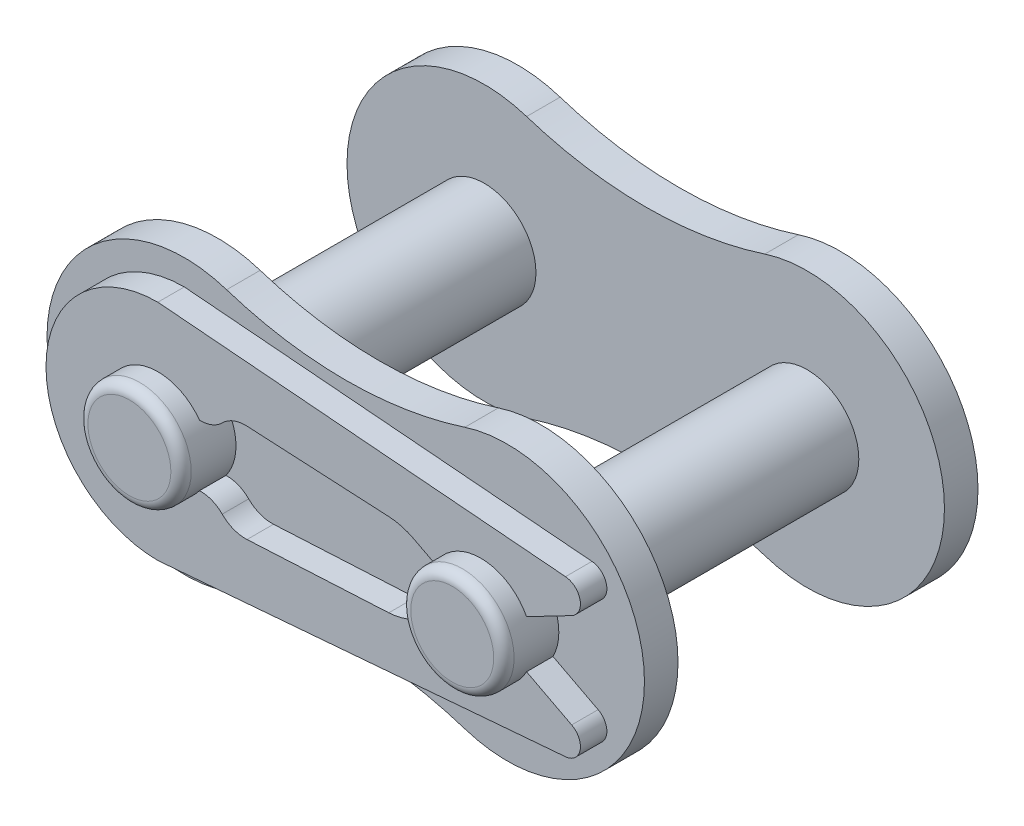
ISO-10303-21;
HEADER;
FILE_DESCRIPTION(('STEP AP214'),'2;1');
FILE_NAME('part.step','',(''),(''),'','','');
FILE_SCHEMA(('AUTOMOTIVE_DESIGN { 1 0 10303 214 1 1 1 1 }'));
ENDSEC;
DATA;
#1=APPLICATION_CONTEXT('core data for automotive mechanical design processes');
#2=APPLICATION_PROTOCOL_DEFINITION('international standard','automotive_design',2000,#1);
#3=PRODUCT_CONTEXT('',#1,'mechanical');
#4=PRODUCT('Part','Part','',(#3));
#5=PRODUCT_RELATED_PRODUCT_CATEGORY('part','',(#4));
#6=PRODUCT_DEFINITION_FORMATION('','',#4);
#7=PRODUCT_DEFINITION_CONTEXT('part definition',#1,'design');
#8=PRODUCT_DEFINITION('design','',#6,#7);
#9=PRODUCT_DEFINITION_SHAPE('','',#8);
#10=(LENGTH_UNIT() NAMED_UNIT(*) SI_UNIT(.MILLI.,.METRE.));
#11=(NAMED_UNIT(*) PLANE_ANGLE_UNIT() SI_UNIT($,.RADIAN.));
#12=(NAMED_UNIT(*) SI_UNIT($,.STERADIAN.) SOLID_ANGLE_UNIT());
#13=UNCERTAINTY_MEASURE_WITH_UNIT(LENGTH_MEASURE(1.E-05),#10,'distance_accuracy_value','');
#14=(GEOMETRIC_REPRESENTATION_CONTEXT(3) GLOBAL_UNCERTAINTY_ASSIGNED_CONTEXT((#13)) GLOBAL_UNIT_ASSIGNED_CONTEXT((#10,
#11,#12)) REPRESENTATION_CONTEXT('',''));
#15=CARTESIAN_POINT('',(0.,0.,0.));
#16=DIRECTION('',(0.,0.,1.));
#17=DIRECTION('',(1.,0.,0.));
#18=AXIS2_PLACEMENT_3D('',#15,#16,#17);
#19=CARTESIAN_POINT('',(-3.96875,12.2480467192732,8.2));
#20=DIRECTION('',(0.,0.,-1.));
#21=DIRECTION('',(1.,0.,0.));
#22=AXIS2_PLACEMENT_3D('',#19,#20,#21);
#23=PLANE('',#22);
#24=CARTESIAN_POINT('',(-13.775,3.,8.2));
#25=DIRECTION('',(0.,0.,1.));
#26=DIRECTION('',(1.,0.,0.));
#27=AXIS2_PLACEMENT_3D('',#24,#25,#26);
#28=CIRCLE('',#27,1.5);
#29=CARTESIAN_POINT('',(-13.8258507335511,1.50086218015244,8.2));
#30=VERTEX_POINT('',#29);
#31=CARTESIAN_POINT('',(-12.7104838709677,1.94320985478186,8.2));
#32=VERTEX_POINT('',#31);
#33=EDGE_CURVE('E298',#30,#32,#28,.T.);
#34=ORIENTED_EDGE('',*,*,#33,.F.);
#35=CARTESIAN_POINT('',(-15.875,0.,8.2));
#36=DIRECTION('',(0.,0.,-1.));
#37=DIRECTION('',(-1.,0.,0.));
#38=AXIS2_PLACEMENT_3D('',#35,#36,#37);
#39=CIRCLE('',#38,2.54);
#40=CARTESIAN_POINT('',(-13.8258507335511,-1.50086218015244,8.2));
#41=VERTEX_POINT('',#40);
#42=EDGE_CURVE('E39',#41,#30,#39,.F.);
#43=ORIENTED_EDGE('',*,*,#42,.F.);
#44=CARTESIAN_POINT('',(-13.775,-3.,8.2));
#45=DIRECTION('',(0.,0.,1.));
#46=DIRECTION('',(1.,0.,0.));
#47=AXIS2_PLACEMENT_3D('',#44,#45,#46);
#48=CIRCLE('',#47,1.5);
#49=CARTESIAN_POINT('',(-12.7104838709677,-1.94320985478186,8.2));
#50=VERTEX_POINT('',#49);
#51=EDGE_CURVE('E237',#41,#50,#48,.F.);
#52=ORIENTED_EDGE('',*,*,#51,.T.);
#53=CARTESIAN_POINT('',(-11.575,-0.815967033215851,8.2));
#54=DIRECTION('',(0.,0.,1.));
#55=DIRECTION('',(1.,0.,0.));
#56=AXIS2_PLACEMENT_3D('',#53,#54,#55);
#57=CIRCLE('',#56,1.6);
#58=CARTESIAN_POINT('',(-11.4912624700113,-2.41377428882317,8.2));
#59=VERTEX_POINT('',#58);
#60=EDGE_CURVE('E251',#59,#50,#57,.F.);
#61=ORIENTED_EDGE('',*,*,#60,.F.);
#62=DIRECTION('',(-0.998629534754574,-0.0523359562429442,0.));
#63=VECTOR('',#62,1.);
#64=CARTESIAN_POINT('',(0.094678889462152,-1.80658083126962,8.2));
#65=LINE('',#64,#63);
#66=CARTESIAN_POINT('',(-4.51997212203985,-2.04842444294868,8.2));
#67=VERTEX_POINT('',#66);
#68=EDGE_CURVE('E335',#67,#59,#65,.T.);
#69=ORIENTED_EDGE('',*,*,#68,.F.);
#70=CARTESIAN_POINT('',(-4.67697999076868,0.947464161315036,8.2));
#71=DIRECTION('',(0.,0.,1.));
#72=DIRECTION('',(1.,0.,0.));
#73=AXIS2_PLACEMENT_3D('',#70,#71,#72);
#74=CIRCLE('',#73,3.);
#75=CARTESIAN_POINT('',(-3.29173415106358,-1.71356833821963,8.2));
#76=VERTEX_POINT('',#75);
#77=EDGE_CURVE('E333',#76,#67,#74,.F.);
#78=ORIENTED_EDGE('',*,*,#77,.F.);
#79=DIRECTION('',(0.887010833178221,0.461748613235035,0.));
#80=VECTOR('',#79,1.);
#81=CARTESIAN_POINT('',(0.,0.,8.2));
#82=LINE('',#81,#80);
#83=CARTESIAN_POINT('',(-2.25300751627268,-1.17284147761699,8.2));
#84=VERTEX_POINT('',#83);
#85=EDGE_CURVE('E330',#76,#84,#82,.T.);
#86=ORIENTED_EDGE('',*,*,#85,.T.);
#87=CARTESIAN_POINT('',(0.,0.,8.2));
#88=DIRECTION('',(0.,0.,-1.));
#89=DIRECTION('',(-1.,0.,0.));
#90=AXIS2_PLACEMENT_3D('',#87,#88,#89);
#91=CIRCLE('',#90,2.54);
#92=CARTESIAN_POINT('',(-2.25300751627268,1.17284147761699,8.2));
#93=VERTEX_POINT('',#92);
#94=EDGE_CURVE('E44',#84,#93,#91,.T.);
#95=ORIENTED_EDGE('',*,*,#94,.T.);
#96=DIRECTION('',(0.887010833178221,-0.461748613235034,0.));
#97=VECTOR('',#96,1.);
#98=CARTESIAN_POINT('',(0.,0.,8.2));
#99=LINE('',#98,#97);
#100=CARTESIAN_POINT('',(-3.29173415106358,1.71356833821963,8.2));
#101=VERTEX_POINT('',#100);
#102=EDGE_CURVE('E310',#101,#93,#99,.T.);
#103=ORIENTED_EDGE('',*,*,#102,.F.);
#104=CARTESIAN_POINT('',(-4.67697999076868,-0.947464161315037,8.2));
#105=DIRECTION('',(0.,0.,1.));
#106=DIRECTION('',(1.,0.,0.));
#107=AXIS2_PLACEMENT_3D('',#104,#105,#106);
#108=CIRCLE('',#107,3.);
#109=CARTESIAN_POINT('',(-4.51997212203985,2.04842444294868,8.2));
#110=VERTEX_POINT('',#109);
#111=EDGE_CURVE('E307',#101,#110,#108,.T.);
#112=ORIENTED_EDGE('',*,*,#111,.T.);
#113=DIRECTION('',(-0.998629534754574,0.0523359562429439,0.));
#114=VECTOR('',#113,1.);
#115=CARTESIAN_POINT('',(0.0946788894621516,1.80658083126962,8.2));
#116=LINE('',#115,#114);
#117=CARTESIAN_POINT('',(-11.4912624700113,2.41377428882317,8.2));
#118=VERTEX_POINT('',#117);
#119=EDGE_CURVE('E304',#110,#118,#116,.T.);
#120=ORIENTED_EDGE('',*,*,#119,.T.);
#121=CARTESIAN_POINT('',(-11.575,0.815967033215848,8.2));
#122=DIRECTION('',(0.,0.,1.));
#123=DIRECTION('',(1.,0.,0.));
#124=AXIS2_PLACEMENT_3D('',#121,#122,#123);
#125=CIRCLE('',#124,1.6);
#126=EDGE_CURVE('E301',#118,#32,#125,.T.);
#127=ORIENTED_EDGE('',*,*,#126,.T.);
#128=EDGE_LOOP('',(#34,#43,#52,#61,#69,#78,#86,#95,#103,#112,#120,#127));
#129=FACE_BOUND('',#128,.T.);
#130=ADVANCED_FACE('F35',(#129),#23,.F.);
#131=CARTESIAN_POINT('',(-7.9375,24.4960934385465,8.2));
#132=DIRECTION('',(0.,0.,-1.));
#133=DIRECTION('',(1.,0.,0.));
#134=AXIS2_PLACEMENT_3D('',#131,#132,#133);
#135=CIRCLE('',#134,19.);
#136=CARTESIAN_POINT('',(-2.08070388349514,6.42130604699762,8.2));
#137=VERTEX_POINT('',#136);
#138=CARTESIAN_POINT('',(-13.7942961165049,6.42130604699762,8.2));
#139=VERTEX_POINT('',#138);
#140=EDGE_CURVE('E407',#137,#139,#135,.T.);
#141=ORIENTED_EDGE('',*,*,#140,.T.);
#142=CARTESIAN_POINT('',(-15.875,0.,8.2));
#143=DIRECTION('',(0.,0.,1.));
#144=DIRECTION('',(1.,0.,0.));
#145=AXIS2_PLACEMENT_3D('',#142,#143,#144);
#146=CIRCLE('',#145,6.75);
#147=CARTESIAN_POINT('',(-13.7942961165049,-6.42130604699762,8.2));
#148=VERTEX_POINT('',#147);
#149=EDGE_CURVE('E399',#139,#148,#146,.T.);
#150=ORIENTED_EDGE('',*,*,#149,.T.);
#151=CARTESIAN_POINT('',(-7.9375,-24.4960934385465,8.2));
#152=DIRECTION('',(0.,0.,-1.));
#153=DIRECTION('',(-1.,0.,0.));
#154=AXIS2_PLACEMENT_3D('',#151,#152,#153);
#155=CIRCLE('',#154,19.);
#156=CARTESIAN_POINT('',(-2.08070388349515,-6.42130604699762,8.2));
#157=VERTEX_POINT('',#156);
#158=EDGE_CURVE('E391',#148,#157,#155,.T.);
#159=ORIENTED_EDGE('',*,*,#158,.T.);
#160=CARTESIAN_POINT('',(0.,0.,8.2));
#161=DIRECTION('',(0.,0.,1.));
#162=DIRECTION('',(1.,0.,0.));
#163=AXIS2_PLACEMENT_3D('',#160,#161,#162);
#164=CIRCLE('',#163,6.75);
#165=EDGE_CURVE('E242',#157,#137,#164,.T.);
#166=ORIENTED_EDGE('',*,*,#165,.T.);
#167=EDGE_LOOP('',(#141,#150,#159,#166));
#168=FACE_BOUND('',#167,.T.);
#169=DIRECTION('',(0.887010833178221,0.461748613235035,0.));
#170=VECTOR('',#169,1.);
#171=CARTESIAN_POINT('',(0.,0.,8.2));
#172=LINE('',#171,#170);
#173=CARTESIAN_POINT('',(2.25300751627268,1.17284147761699,8.2));
#174=VERTEX_POINT('',#173);
#175=CARTESIAN_POINT('',(4.47141651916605,2.32767210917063,8.2));
#176=VERTEX_POINT('',#175);
#177=EDGE_CURVE('E312',#174,#176,#172,.T.);
#178=ORIENTED_EDGE('',*,*,#177,.F.);
#179=CARTESIAN_POINT('',(2.25300751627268,-1.17284147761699,8.2));
#180=VERTEX_POINT('',#179);
#181=EDGE_CURVE('E11',#174,#180,#91,.T.);
#182=ORIENTED_EDGE('',*,*,#181,.T.);
#183=DIRECTION('',(0.887010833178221,-0.461748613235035,0.));
#184=VECTOR('',#183,1.);
#185=CARTESIAN_POINT('',(0.,0.,8.2));
#186=LINE('',#185,#184);
#187=CARTESIAN_POINT('',(4.47141651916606,-2.32767210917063,8.2));
#188=VERTEX_POINT('',#187);
#189=EDGE_CURVE('E327',#180,#188,#186,.T.);
#190=ORIENTED_EDGE('',*,*,#189,.T.);
#191=CARTESIAN_POINT('',(4.10201762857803,-3.03728077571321,8.2));
#192=DIRECTION('',(0.,0.,1.));
#193=DIRECTION('',(1.,0.,0.));
#194=AXIS2_PLACEMENT_3D('',#191,#192,#193);
#195=CIRCLE('',#194,0.799999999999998);
#196=CARTESIAN_POINT('',(4.16826419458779,-3.83453317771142,8.2));
#197=VERTEX_POINT('',#196);
#198=EDGE_CURVE('E324',#197,#188,#195,.T.);
#199=ORIENTED_EDGE('',*,*,#198,.F.);
#200=DIRECTION('',(0.996565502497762,0.0828082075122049,0.));
#201=VECTOR('',#200,1.);
#202=CARTESIAN_POINT('',(0.345022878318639,-4.15222003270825,8.2));
#203=LINE('',#202,#201);
#204=CARTESIAN_POINT('',(-15.875,-5.5,8.2));
#205=VERTEX_POINT('',#204);
#206=EDGE_CURVE('E322',#205,#197,#203,.T.);
#207=ORIENTED_EDGE('',*,*,#206,.F.);
#208=CARTESIAN_POINT('',(-15.875,0.,8.2));
#209=DIRECTION('',(0.,0.,1.));
#210=DIRECTION('',(1.,0.,0.));
#211=AXIS2_PLACEMENT_3D('',#208,#209,#210);
#212=CIRCLE('',#211,5.5);
#213=CARTESIAN_POINT('',(-15.875,5.5,8.2));
#214=VERTEX_POINT('',#213);
#215=EDGE_CURVE('E320',#214,#205,#212,.T.);
#216=ORIENTED_EDGE('',*,*,#215,.F.);
#217=DIRECTION('',(0.996565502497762,-0.0828082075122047,0.));
#218=VECTOR('',#217,1.);
#219=CARTESIAN_POINT('',(0.345022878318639,4.15222003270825,8.2));
#220=LINE('',#219,#218);
#221=CARTESIAN_POINT('',(4.16826419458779,3.83453317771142,8.2));
#222=VERTEX_POINT('',#221);
#223=EDGE_CURVE('E317',#214,#222,#220,.T.);
#224=ORIENTED_EDGE('',*,*,#223,.T.);
#225=CARTESIAN_POINT('',(4.10201762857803,3.03728077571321,8.2));
#226=DIRECTION('',(0.,0.,1.));
#227=DIRECTION('',(1.,0.,0.));
#228=AXIS2_PLACEMENT_3D('',#225,#226,#227);
#229=CIRCLE('',#228,0.799999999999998);
#230=EDGE_CURVE('E314',#176,#222,#229,.T.);
#231=ORIENTED_EDGE('',*,*,#230,.F.);
#232=EDGE_LOOP('',(#178,#182,#190,#199,#207,#216,#224,#231));
#233=FACE_BOUND('',#232,.T.);
#234=ADVANCED_FACE('F497',(#168,#233),#23,.F.);
#235=CARTESIAN_POINT('',(0.,0.,-10.625));
#236=DIRECTION('',(0.,0.,-1.));
#237=DIRECTION('',(-1.,0.,0.));
#238=AXIS2_PLACEMENT_3D('',#235,#236,#237);
#239=CYLINDRICAL_SURFACE('',#238,2.54);
#240=CARTESIAN_POINT('',(0.,0.,10.4));
#241=DIRECTION('',(0.,0.,-1.));
#242=DIRECTION('',(-1.,0.,0.));
#243=AXIS2_PLACEMENT_3D('',#240,#241,#242);
#244=CIRCLE('',#243,2.54);
#245=CARTESIAN_POINT('',(-2.54,0.,10.4));
#246=VERTEX_POINT('',#245);
#247=EDGE_CURVE('E462',#246,#246,#244,.T.);
#248=ORIENTED_EDGE('',*,*,#247,.T.);
#249=EDGE_LOOP('',(#248));
#250=FACE_BOUND('',#249,.T.);
#251=DIRECTION('',(0.,0.,-1.));
#252=VECTOR('',#251,1.);
#253=CARTESIAN_POINT('',(-2.25300751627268,1.17284147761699,9.5));
#254=LINE('',#253,#252);
#255=CARTESIAN_POINT('',(-2.25300751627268,1.17284147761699,9.5));
#256=VERTEX_POINT('',#255);
#257=EDGE_CURVE('E370',#256,#93,#254,.T.);
#258=ORIENTED_EDGE('',*,*,#257,.T.);
#259=ORIENTED_EDGE('',*,*,#94,.F.);
#260=DIRECTION('',(0.,0.,-1.));
#261=VECTOR('',#260,1.);
#262=CARTESIAN_POINT('',(-2.25300751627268,-1.17284147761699,9.5));
#263=LINE('',#262,#261);
#264=CARTESIAN_POINT('',(-2.25300751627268,-1.17284147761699,9.5));
#265=VERTEX_POINT('',#264);
#266=EDGE_CURVE('E348',#265,#84,#263,.T.);
#267=ORIENTED_EDGE('',*,*,#266,.F.);
#268=CARTESIAN_POINT('',(0.,0.,9.5));
#269=DIRECTION('',(0.,0.,1.));
#270=DIRECTION('',(1.,0.,0.));
#271=AXIS2_PLACEMENT_3D('',#268,#269,#270);
#272=CIRCLE('',#271,2.54);
#273=CARTESIAN_POINT('',(2.25300751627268,-1.17284147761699,9.5));
#274=VERTEX_POINT('',#273);
#275=EDGE_CURVE('E274',#274,#265,#272,.F.);
#276=ORIENTED_EDGE('',*,*,#275,.F.);
#277=DIRECTION('',(0.,0.,-1.));
#278=VECTOR('',#277,1.);
#279=CARTESIAN_POINT('',(2.25300751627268,-1.17284147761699,9.5));
#280=LINE('',#279,#278);
#281=EDGE_CURVE('E350',#274,#180,#280,.T.);
#282=ORIENTED_EDGE('',*,*,#281,.T.);
#283=ORIENTED_EDGE('',*,*,#181,.F.);
#284=DIRECTION('',(0.,0.,-1.));
#285=VECTOR('',#284,1.);
#286=CARTESIAN_POINT('',(2.25300751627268,1.17284147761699,9.5));
#287=LINE('',#286,#285);
#288=CARTESIAN_POINT('',(2.25300751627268,1.17284147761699,9.5));
#289=VERTEX_POINT('',#288);
#290=EDGE_CURVE('E368',#289,#174,#287,.T.);
#291=ORIENTED_EDGE('',*,*,#290,.F.);
#292=EDGE_CURVE('E271',#256,#289,#272,.F.);
#293=ORIENTED_EDGE('',*,*,#292,.F.);
#294=EDGE_LOOP('',(#258,#259,#267,#276,#282,#283,#291,#293));
#295=FACE_BOUND('',#294,.T.);
#296=ADVANCED_FACE('F503',(#250,#295),#239,.T.);
#297=CARTESIAN_POINT('',(0.,0.,6.55));
#298=DIRECTION('',(0.,0.,-1.));
#299=DIRECTION('',(-1.,0.,0.));
#300=AXIS2_PLACEMENT_3D('',#297,#298,#299);
#301=CIRCLE('',#300,2.54);
#302=CARTESIAN_POINT('',(-2.54,0.,6.55));
#303=VERTEX_POINT('',#302);
#304=EDGE_CURVE('E413',#303,#303,#301,.T.);
#305=ORIENTED_EDGE('',*,*,#304,.T.);
#306=EDGE_LOOP('',(#305));
#307=FACE_BOUND('',#306,.T.);
#308=CARTESIAN_POINT('',(0.,0.,-6.55));
#309=DIRECTION('',(0.,0.,1.));
#310=DIRECTION('',(1.,0.,0.));
#311=AXIS2_PLACEMENT_3D('',#308,#309,#310);
#312=CIRCLE('',#311,2.54);
#313=CARTESIAN_POINT('',(2.54,0.,-6.55));
#314=VERTEX_POINT('',#313);
#315=EDGE_CURVE('E430',#314,#314,#312,.T.);
#316=ORIENTED_EDGE('',*,*,#315,.T.);
#317=EDGE_LOOP('',(#316));
#318=FACE_BOUND('',#317,.T.);
#319=ADVANCED_FACE('F491',(#307,#318),#239,.T.);
#320=CARTESIAN_POINT('',(-3.96875,12.2480467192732,-8.2));
#321=DIRECTION('',(0.,0.,1.));
#322=DIRECTION('',(1.,0.,0.));
#323=AXIS2_PLACEMENT_3D('',#320,#321,#322);
#324=PLANE('',#323);
#325=CARTESIAN_POINT('',(-15.875,0.,-8.2));
#326=DIRECTION('',(0.,0.,1.));
#327=DIRECTION('',(1.,0.,0.));
#328=AXIS2_PLACEMENT_3D('',#325,#326,#327);
#329=CIRCLE('',#328,4.1);
#330=CARTESIAN_POINT('',(-11.775,0.,-8.2));
#331=VERTEX_POINT('',#330);
#332=EDGE_CURVE('E421',#331,#331,#329,.T.);
#333=ORIENTED_EDGE('',*,*,#332,.T.);
#334=EDGE_LOOP('',(#333));
#335=FACE_BOUND('',#334,.T.);
#336=CARTESIAN_POINT('',(-7.9375,24.4960934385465,-8.2));
#337=DIRECTION('',(0.,0.,-1.));
#338=DIRECTION('',(1.,0.,0.));
#339=AXIS2_PLACEMENT_3D('',#336,#337,#338);
#340=CIRCLE('',#339,19.);
#341=CARTESIAN_POINT('',(-2.08070388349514,6.42130604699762,-8.2));
#342=VERTEX_POINT('',#341);
#343=CARTESIAN_POINT('',(-13.7942961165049,6.42130604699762,-8.2));
#344=VERTEX_POINT('',#343);
#345=EDGE_CURVE('E433',#342,#344,#340,.T.);
#346=ORIENTED_EDGE('',*,*,#345,.F.);
#347=CARTESIAN_POINT('',(0.,0.,-8.2));
#348=DIRECTION('',(0.,0.,1.));
#349=DIRECTION('',(1.,0.,0.));
#350=AXIS2_PLACEMENT_3D('',#347,#348,#349);
#351=CIRCLE('',#350,6.75);
#352=CARTESIAN_POINT('',(-2.08070388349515,-6.42130604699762,-8.2));
#353=VERTEX_POINT('',#352);
#354=EDGE_CURVE('E82',#353,#342,#351,.T.);
#355=ORIENTED_EDGE('',*,*,#354,.F.);
#356=CARTESIAN_POINT('',(-7.9375,-24.4960934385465,-8.2));
#357=DIRECTION('',(0.,0.,-1.));
#358=DIRECTION('',(-1.,0.,0.));
#359=AXIS2_PLACEMENT_3D('',#356,#357,#358);
#360=CIRCLE('',#359,19.);
#361=CARTESIAN_POINT('',(-13.7942961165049,-6.42130604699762,-8.2));
#362=VERTEX_POINT('',#361);
#363=EDGE_CURVE('E445',#362,#353,#360,.T.);
#364=ORIENTED_EDGE('',*,*,#363,.F.);
#365=CARTESIAN_POINT('',(-15.875,0.,-8.2));
#366=DIRECTION('',(0.,0.,1.));
#367=DIRECTION('',(1.,0.,0.));
#368=AXIS2_PLACEMENT_3D('',#365,#366,#367);
#369=CIRCLE('',#368,6.75);
#370=EDGE_CURVE('E443',#344,#362,#369,.T.);
#371=ORIENTED_EDGE('',*,*,#370,.F.);
#372=EDGE_LOOP('',(#346,#355,#364,#371));
#373=FACE_BOUND('',#372,.T.);
#374=CARTESIAN_POINT('',(0.,0.,-8.2));
#375=DIRECTION('',(0.,0.,1.));
#376=DIRECTION('',(1.,0.,0.));
#377=AXIS2_PLACEMENT_3D('',#374,#375,#376);
#378=CIRCLE('',#377,4.1);
#379=CARTESIAN_POINT('',(4.1,0.,-8.2));
#380=VERTEX_POINT('',#379);
#381=EDGE_CURVE('E456',#380,#380,#378,.T.);
#382=ORIENTED_EDGE('',*,*,#381,.T.);
#383=EDGE_LOOP('',(#382));
#384=FACE_BOUND('',#383,.T.);
#385=ADVANCED_FACE('F481',(#335,#373,#384),#324,.F.);
#386=CARTESIAN_POINT('',(-3.96875,12.2480467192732,-6.55));
#387=DIRECTION('',(0.,0.,1.));
#388=DIRECTION('',(1.,0.,0.));
#389=AXIS2_PLACEMENT_3D('',#386,#387,#388);
#390=PLANE('',#389);
#391=ORIENTED_EDGE('',*,*,#315,.F.);
#392=EDGE_LOOP('',(#391));
#393=FACE_BOUND('',#392,.T.);
#394=CARTESIAN_POINT('',(-7.9375,24.4960934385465,-6.55));
#395=DIRECTION('',(0.,0.,-1.));
#396=DIRECTION('',(1.,0.,0.));
#397=AXIS2_PLACEMENT_3D('',#394,#395,#396);
#398=CIRCLE('',#397,19.);
#399=CARTESIAN_POINT('',(-2.08070388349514,6.42130604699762,-6.55));
#400=VERTEX_POINT('',#399);
#401=CARTESIAN_POINT('',(-13.7942961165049,6.42130604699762,-6.55));
#402=VERTEX_POINT('',#401);
#403=EDGE_CURVE('E434',#400,#402,#398,.T.);
#404=ORIENTED_EDGE('',*,*,#403,.T.);
#405=CARTESIAN_POINT('',(-15.875,0.,-6.55));
#406=DIRECTION('',(0.,0.,1.));
#407=DIRECTION('',(1.,0.,0.));
#408=AXIS2_PLACEMENT_3D('',#405,#406,#407);
#409=CIRCLE('',#408,6.75);
#410=CARTESIAN_POINT('',(-13.7942961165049,-6.42130604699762,-6.55));
#411=VERTEX_POINT('',#410);
#412=EDGE_CURVE('E90',#402,#411,#409,.T.);
#413=ORIENTED_EDGE('',*,*,#412,.T.);
#414=CARTESIAN_POINT('',(-7.9375,-24.4960934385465,-6.55));
#415=DIRECTION('',(0.,0.,-1.));
#416=DIRECTION('',(-1.,0.,0.));
#417=AXIS2_PLACEMENT_3D('',#414,#415,#416);
#418=CIRCLE('',#417,19.);
#419=CARTESIAN_POINT('',(-2.08070388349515,-6.42130604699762,-6.55));
#420=VERTEX_POINT('',#419);
#421=EDGE_CURVE('E437',#411,#420,#418,.T.);
#422=ORIENTED_EDGE('',*,*,#421,.T.);
#423=CARTESIAN_POINT('',(0.,0.,-6.55));
#424=DIRECTION('',(0.,0.,1.));
#425=DIRECTION('',(1.,0.,0.));
#426=AXIS2_PLACEMENT_3D('',#423,#424,#425);
#427=CIRCLE('',#426,6.75);
#428=EDGE_CURVE('E61',#420,#400,#427,.T.);
#429=ORIENTED_EDGE('',*,*,#428,.T.);
#430=EDGE_LOOP('',(#404,#413,#422,#429));
#431=FACE_BOUND('',#430,.T.);
#432=CARTESIAN_POINT('',(-15.875,0.,-6.55));
#433=DIRECTION('',(0.,0.,1.));
#434=DIRECTION('',(1.,0.,0.));
#435=AXIS2_PLACEMENT_3D('',#432,#433,#434);
#436=CIRCLE('',#435,2.54);
#437=CARTESIAN_POINT('',(-13.335,0.,-6.55));
#438=VERTEX_POINT('',#437);
#439=EDGE_CURVE('E427',#438,#438,#436,.T.);
#440=ORIENTED_EDGE('',*,*,#439,.F.);
#441=EDGE_LOOP('',(#440));
#442=FACE_BOUND('',#441,.T.);
#443=ADVANCED_FACE('F478',(#393,#431,#442),#390,.T.);
#444=CARTESIAN_POINT('',(-7.9375,24.4960934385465,-6.55));
#445=DIRECTION('',(0.,0.,-1.));
#446=DIRECTION('',(-1.,0.,0.));
#447=AXIS2_PLACEMENT_3D('',#444,#445,#446);
#448=CYLINDRICAL_SURFACE('',#447,19.);
#449=ORIENTED_EDGE('',*,*,#345,.T.);
#450=DIRECTION('',(0.,0.,-1.));
#451=VECTOR('',#450,1.);
#452=CARTESIAN_POINT('',(-13.7942961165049,6.42130604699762,-6.55));
#453=LINE('',#452,#451);
#454=EDGE_CURVE('E454',#402,#344,#453,.T.);
#455=ORIENTED_EDGE('',*,*,#454,.F.);
#456=ORIENTED_EDGE('',*,*,#403,.F.);
#457=DIRECTION('',(0.,0.,-1.));
#458=VECTOR('',#457,1.);
#459=CARTESIAN_POINT('',(-2.08070388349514,6.42130604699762,-6.55));
#460=LINE('',#459,#458);
#461=EDGE_CURVE('E440',#400,#342,#460,.T.);
#462=ORIENTED_EDGE('',*,*,#461,.T.);
#463=EDGE_LOOP('',(#449,#455,#456,#462));
#464=FACE_BOUND('',#463,.T.);
#465=ADVANCED_FACE('F480',(#464),#448,.F.);
#466=CARTESIAN_POINT('',(-15.875,0.,-6.55));
#467=DIRECTION('',(0.,0.,-1.));
#468=DIRECTION('',(-1.,0.,0.));
#469=AXIS2_PLACEMENT_3D('',#466,#467,#468);
#470=CYLINDRICAL_SURFACE('',#469,6.75);
#471=ORIENTED_EDGE('',*,*,#370,.T.);
#472=DIRECTION('',(0.,0.,-1.));
#473=VECTOR('',#472,1.);
#474=CARTESIAN_POINT('',(-13.7942961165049,-6.42130604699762,-6.55));
#475=LINE('',#474,#473);
#476=EDGE_CURVE('E451',#411,#362,#475,.T.);
#477=ORIENTED_EDGE('',*,*,#476,.F.);
#478=ORIENTED_EDGE('',*,*,#412,.F.);
#479=ORIENTED_EDGE('',*,*,#454,.T.);
#480=EDGE_LOOP('',(#471,#477,#478,#479));
#481=FACE_BOUND('',#480,.T.);
#482=ADVANCED_FACE('F488',(#481),#470,.T.);
#483=CARTESIAN_POINT('',(-7.9375,-24.4960934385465,-6.55));
#484=DIRECTION('',(0.,0.,-1.));
#485=DIRECTION('',(-1.,0.,0.));
#486=AXIS2_PLACEMENT_3D('',#483,#484,#485);
#487=CYLINDRICAL_SURFACE('',#486,19.);
#488=ORIENTED_EDGE('',*,*,#363,.T.);
#489=DIRECTION('',(0.,0.,-1.));
#490=VECTOR('',#489,1.);
#491=CARTESIAN_POINT('',(-2.08070388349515,-6.42130604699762,-6.55));
#492=LINE('',#491,#490);
#493=EDGE_CURVE('E449',#420,#353,#492,.T.);
#494=ORIENTED_EDGE('',*,*,#493,.F.);
#495=ORIENTED_EDGE('',*,*,#421,.F.);
#496=ORIENTED_EDGE('',*,*,#476,.T.);
#497=EDGE_LOOP('',(#488,#494,#495,#496));
#498=FACE_BOUND('',#497,.T.);
#499=ADVANCED_FACE('F751',(#498),#487,.F.);
#500=CARTESIAN_POINT('',(0.,0.,-6.55));
#501=DIRECTION('',(0.,0.,-1.));
#502=DIRECTION('',(-1.,0.,0.));
#503=AXIS2_PLACEMENT_3D('',#500,#501,#502);
#504=CYLINDRICAL_SURFACE('',#503,6.75);
#505=ORIENTED_EDGE('',*,*,#354,.T.);
#506=ORIENTED_EDGE('',*,*,#461,.F.);
#507=ORIENTED_EDGE('',*,*,#428,.F.);
#508=ORIENTED_EDGE('',*,*,#493,.T.);
#509=EDGE_LOOP('',(#505,#506,#507,#508));
#510=FACE_BOUND('',#509,.T.);
#511=ADVANCED_FACE('F539',(#510),#504,.T.);
#512=CARTESIAN_POINT('',(0.,0.,-2.89642857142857));
#513=DIRECTION('',(0.,0.,-1.));
#514=DIRECTION('',(1.,0.,0.));
#515=AXIS2_PLACEMENT_3D('',#512,#513,#514);
#516=SPHERICAL_SURFACE('',#515,6.70357142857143);
#517=ORIENTED_EDGE('',*,*,#381,.F.);
#518=EDGE_LOOP('',(#517));
#519=FACE_BOUND('',#518,.T.);
#520=ADVANCED_FACE('F474',(#519),#516,.T.);
#521=CARTESIAN_POINT('',(-15.875,0.,10.9));
#522=DIRECTION('',(0.,0.,1.));
#523=DIRECTION('',(1.,0.,0.));
#524=AXIS2_PLACEMENT_3D('',#521,#522,#523);
#525=CYLINDRICAL_SURFACE('',#524,2.54);
#526=CARTESIAN_POINT('',(-15.875,0.,6.55));
#527=DIRECTION('',(0.,0.,-1.));
#528=DIRECTION('',(-1.,0.,0.));
#529=AXIS2_PLACEMENT_3D('',#526,#527,#528);
#530=CIRCLE('',#529,2.54);
#531=CARTESIAN_POINT('',(-18.415,0.,6.55));
#532=VERTEX_POINT('',#531);
#533=EDGE_CURVE('E417',#532,#532,#530,.F.);
#534=ORIENTED_EDGE('',*,*,#533,.F.);
#535=EDGE_LOOP('',(#534));
#536=FACE_BOUND('',#535,.T.);
#537=ORIENTED_EDGE('',*,*,#439,.T.);
#538=EDGE_LOOP('',(#537));
#539=FACE_BOUND('',#538,.T.);
#540=ADVANCED_FACE('F470',(#536,#539),#525,.T.);
#541=CARTESIAN_POINT('',(-15.875,0.,-2.89642857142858));
#542=DIRECTION('',(0.,0.,1.));
#543=DIRECTION('',(-1.,0.,0.));
#544=AXIS2_PLACEMENT_3D('',#541,#542,#543);
#545=SPHERICAL_SURFACE('',#544,6.70357142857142);
#546=ORIENTED_EDGE('',*,*,#332,.F.);
#547=EDGE_LOOP('',(#546));
#548=FACE_BOUND('',#547,.T.);
#549=ADVANCED_FACE('F473',(#548),#545,.T.);
#550=CARTESIAN_POINT('',(-3.96875,12.2480467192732,6.55));
#551=DIRECTION('',(0.,0.,-1.));
#552=DIRECTION('',(1.,0.,0.));
#553=AXIS2_PLACEMENT_3D('',#550,#551,#552);
#554=PLANE('',#553);
#555=ORIENTED_EDGE('',*,*,#533,.T.);
#556=EDGE_LOOP('',(#555));
#557=FACE_BOUND('',#556,.T.);
#558=CARTESIAN_POINT('',(-7.9375,24.4960934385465,6.55));
#559=DIRECTION('',(0.,0.,-1.));
#560=DIRECTION('',(1.,0.,0.));
#561=AXIS2_PLACEMENT_3D('',#558,#559,#560);
#562=CIRCLE('',#561,19.);
#563=CARTESIAN_POINT('',(-2.08070388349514,6.42130604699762,6.55));
#564=VERTEX_POINT('',#563);
#565=CARTESIAN_POINT('',(-13.7942961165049,6.42130604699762,6.55));
#566=VERTEX_POINT('',#565);
#567=EDGE_CURVE('E410',#564,#566,#562,.T.);
#568=ORIENTED_EDGE('',*,*,#567,.F.);
#569=CARTESIAN_POINT('',(0.,0.,6.55));
#570=DIRECTION('',(0.,0.,1.));
#571=DIRECTION('',(1.,0.,0.));
#572=AXIS2_PLACEMENT_3D('',#569,#570,#571);
#573=CIRCLE('',#572,6.75);
#574=CARTESIAN_POINT('',(-2.08070388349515,-6.42130604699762,6.55));
#575=VERTEX_POINT('',#574);
#576=EDGE_CURVE('E386',#575,#564,#573,.T.);
#577=ORIENTED_EDGE('',*,*,#576,.F.);
#578=CARTESIAN_POINT('',(-7.9375,-24.4960934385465,6.55));
#579=DIRECTION('',(0.,0.,-1.));
#580=DIRECTION('',(-1.,0.,0.));
#581=AXIS2_PLACEMENT_3D('',#578,#579,#580);
#582=CIRCLE('',#581,19.);
#583=CARTESIAN_POINT('',(-13.7942961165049,-6.42130604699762,6.55));
#584=VERTEX_POINT('',#583);
#585=EDGE_CURVE('E394',#584,#575,#582,.T.);
#586=ORIENTED_EDGE('',*,*,#585,.F.);
#587=CARTESIAN_POINT('',(-15.875,0.,6.55));
#588=DIRECTION('',(0.,0.,1.));
#589=DIRECTION('',(1.,0.,0.));
#590=AXIS2_PLACEMENT_3D('',#587,#588,#589);
#591=CIRCLE('',#590,6.75);
#592=EDGE_CURVE('E402',#566,#584,#591,.T.);
#593=ORIENTED_EDGE('',*,*,#592,.F.);
#594=EDGE_LOOP('',(#568,#577,#586,#593));
#595=FACE_BOUND('',#594,.T.);
#596=ORIENTED_EDGE('',*,*,#304,.F.);
#597=EDGE_LOOP('',(#596));
#598=FACE_BOUND('',#597,.T.);
#599=ADVANCED_FACE('F467',(#557,#595,#598),#554,.T.);
#600=CARTESIAN_POINT('',(-7.9375,24.4960934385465,6.55));
#601=DIRECTION('',(0.,0.,1.));
#602=DIRECTION('',(-1.,0.,0.));
#603=AXIS2_PLACEMENT_3D('',#600,#601,#602);
#604=CYLINDRICAL_SURFACE('',#603,19.);
#605=ORIENTED_EDGE('',*,*,#140,.F.);
#606=DIRECTION('',(0.,0.,1.));
#607=VECTOR('',#606,1.);
#608=CARTESIAN_POINT('',(-2.08070388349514,6.42130604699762,6.55));
#609=LINE('',#608,#607);
#610=EDGE_CURVE('E384',#564,#137,#609,.T.);
#611=ORIENTED_EDGE('',*,*,#610,.F.);
#612=ORIENTED_EDGE('',*,*,#567,.T.);
#613=DIRECTION('',(0.,0.,1.));
#614=VECTOR('',#613,1.);
#615=CARTESIAN_POINT('',(-13.7942961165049,6.42130604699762,6.55));
#616=LINE('',#615,#614);
#617=EDGE_CURVE('E405',#566,#139,#616,.T.);
#618=ORIENTED_EDGE('',*,*,#617,.T.);
#619=EDGE_LOOP('',(#605,#611,#612,#618));
#620=FACE_BOUND('',#619,.T.);
#621=ADVANCED_FACE('F551',(#620),#604,.F.);
#622=CARTESIAN_POINT('',(-15.875,0.,6.55));
#623=DIRECTION('',(0.,0.,1.));
#624=DIRECTION('',(-1.,0.,0.));
#625=AXIS2_PLACEMENT_3D('',#622,#623,#624);
#626=CYLINDRICAL_SURFACE('',#625,6.75);
#627=ORIENTED_EDGE('',*,*,#149,.F.);
#628=ORIENTED_EDGE('',*,*,#617,.F.);
#629=ORIENTED_EDGE('',*,*,#592,.T.);
#630=DIRECTION('',(0.,0.,1.));
#631=VECTOR('',#630,1.);
#632=CARTESIAN_POINT('',(-13.7942961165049,-6.42130604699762,6.55));
#633=LINE('',#632,#631);
#634=EDGE_CURVE('E397',#584,#148,#633,.T.);
#635=ORIENTED_EDGE('',*,*,#634,.T.);
#636=EDGE_LOOP('',(#627,#628,#629,#635));
#637=FACE_BOUND('',#636,.T.);
#638=ADVANCED_FACE('F555',(#637),#626,.T.);
#639=CARTESIAN_POINT('',(-7.9375,-24.4960934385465,6.55));
#640=DIRECTION('',(0.,0.,1.));
#641=DIRECTION('',(-1.,0.,0.));
#642=AXIS2_PLACEMENT_3D('',#639,#640,#641);
#643=CYLINDRICAL_SURFACE('',#642,19.);
#644=ORIENTED_EDGE('',*,*,#158,.F.);
#645=ORIENTED_EDGE('',*,*,#634,.F.);
#646=ORIENTED_EDGE('',*,*,#585,.T.);
#647=DIRECTION('',(0.,0.,1.));
#648=VECTOR('',#647,1.);
#649=CARTESIAN_POINT('',(-2.08070388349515,-6.42130604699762,6.55));
#650=LINE('',#649,#648);
#651=EDGE_CURVE('E389',#575,#157,#650,.T.);
#652=ORIENTED_EDGE('',*,*,#651,.T.);
#653=EDGE_LOOP('',(#644,#645,#646,#652));
#654=FACE_BOUND('',#653,.T.);
#655=ADVANCED_FACE('F560',(#654),#643,.F.);
#656=CARTESIAN_POINT('',(0.,0.,6.55));
#657=DIRECTION('',(0.,0.,1.));
#658=DIRECTION('',(-1.,0.,0.));
#659=AXIS2_PLACEMENT_3D('',#656,#657,#658);
#660=CYLINDRICAL_SURFACE('',#659,6.75);
#661=ORIENTED_EDGE('',*,*,#165,.F.);
#662=ORIENTED_EDGE('',*,*,#651,.F.);
#663=ORIENTED_EDGE('',*,*,#576,.T.);
#664=ORIENTED_EDGE('',*,*,#610,.T.);
#665=EDGE_LOOP('',(#661,#662,#663,#664));
#666=FACE_BOUND('',#665,.T.);
#667=ADVANCED_FACE('F515',(#666),#660,.T.);
#668=CARTESIAN_POINT('',(-15.875,0.,10.9));
#669=DIRECTION('',(0.,0.,1.));
#670=DIRECTION('',(1.,0.,0.));
#671=AXIS2_PLACEMENT_3D('',#668,#669,#670);
#672=PLANE('',#671);
#673=CARTESIAN_POINT('',(-15.875,0.,10.9));
#674=DIRECTION('',(0.,0.,1.));
#675=DIRECTION('',(1.,0.,0.));
#676=AXIS2_PLACEMENT_3D('',#673,#674,#675);
#677=CIRCLE('',#676,2.04);
#678=CARTESIAN_POINT('',(-13.835,0.,10.9));
#679=VERTEX_POINT('',#678);
#680=EDGE_CURVE('E424',#679,#679,#677,.T.);
#681=ORIENTED_EDGE('',*,*,#680,.T.);
#682=EDGE_LOOP('',(#681));
#683=FACE_BOUND('',#682,.T.);
#684=ADVANCED_FACE('F512',(#683),#672,.T.);
#685=CARTESIAN_POINT('',(-15.875,0.,10.4));
#686=DIRECTION('',(0.,0.,1.));
#687=DIRECTION('',(1.,0.,0.));
#688=AXIS2_PLACEMENT_3D('',#685,#686,#687);
#689=TOROIDAL_SURFACE('',#688,2.04,0.5);
#690=CARTESIAN_POINT('',(-15.875,0.,10.4));
#691=DIRECTION('',(0.,0.,1.));
#692=DIRECTION('',(1.,0.,0.));
#693=AXIS2_PLACEMENT_3D('',#690,#691,#692);
#694=CIRCLE('',#693,2.54);
#695=CARTESIAN_POINT('',(-13.335,0.,10.4));
#696=VERTEX_POINT('',#695);
#697=EDGE_CURVE('E418',#696,#696,#694,.T.);
#698=ORIENTED_EDGE('',*,*,#697,.T.);
#699=EDGE_LOOP('',(#698));
#700=FACE_BOUND('',#699,.T.);
#701=ORIENTED_EDGE('',*,*,#680,.F.);
#702=EDGE_LOOP('',(#701));
#703=FACE_BOUND('',#702,.T.);
#704=ADVANCED_FACE('F514',(#700,#703),#689,.T.);
#705=DIRECTION('',(0.,0.,-1.));
#706=VECTOR('',#705,1.);
#707=CARTESIAN_POINT('',(-13.8258507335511,-1.50086218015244,9.5));
#708=LINE('',#707,#706);
#709=CARTESIAN_POINT('',(-13.8258507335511,-1.50086218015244,9.5));
#710=VERTEX_POINT('',#709);
#711=EDGE_CURVE('E232',#710,#41,#708,.T.);
#712=ORIENTED_EDGE('',*,*,#711,.T.);
#713=ORIENTED_EDGE('',*,*,#42,.T.);
#714=DIRECTION('',(0.,0.,-1.));
#715=VECTOR('',#714,1.);
#716=CARTESIAN_POINT('',(-13.8258507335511,1.50086218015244,9.5));
#717=LINE('',#716,#715);
#718=CARTESIAN_POINT('',(-13.8258507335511,1.50086218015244,9.5));
#719=VERTEX_POINT('',#718);
#720=EDGE_CURVE('E243',#719,#30,#717,.T.);
#721=ORIENTED_EDGE('',*,*,#720,.F.);
#722=CARTESIAN_POINT('',(-15.875,0.,9.5));
#723=DIRECTION('',(0.,0.,1.));
#724=DIRECTION('',(1.,0.,0.));
#725=AXIS2_PLACEMENT_3D('',#722,#723,#724);
#726=CIRCLE('',#725,2.54);
#727=EDGE_CURVE('E246',#710,#719,#726,.F.);
#728=ORIENTED_EDGE('',*,*,#727,.F.);
#729=EDGE_LOOP('',(#712,#713,#721,#728));
#730=FACE_BOUND('',#729,.T.);
#731=ORIENTED_EDGE('',*,*,#697,.F.);
#732=EDGE_LOOP('',(#731));
#733=FACE_BOUND('',#732,.T.);
#734=ADVANCED_FACE('F254',(#730,#733),#525,.T.);
#735=CARTESIAN_POINT('',(2.04,0.,10.9));
#736=DIRECTION('',(0.,0.,-1.));
#737=DIRECTION('',(-1.,0.,0.));
#738=AXIS2_PLACEMENT_3D('',#735,#736,#737);
#739=PLANE('',#738);
#740=CARTESIAN_POINT('',(0.,0.,10.9));
#741=DIRECTION('',(0.,0.,-1.));
#742=DIRECTION('',(-1.,0.,0.));
#743=AXIS2_PLACEMENT_3D('',#740,#741,#742);
#744=CIRCLE('',#743,2.04);
#745=CARTESIAN_POINT('',(-2.04,0.,10.9));
#746=VERTEX_POINT('',#745);
#747=EDGE_CURVE('E459',#746,#746,#744,.T.);
#748=ORIENTED_EDGE('',*,*,#747,.F.);
#749=EDGE_LOOP('',(#748));
#750=FACE_BOUND('',#749,.T.);
#751=ADVANCED_FACE('F522',(#750),#739,.F.);
#752=CARTESIAN_POINT('',(0.,0.,10.4));
#753=DIRECTION('',(0.,0.,-1.));
#754=DIRECTION('',(-1.,0.,0.));
#755=AXIS2_PLACEMENT_3D('',#752,#753,#754);
#756=TOROIDAL_SURFACE('',#755,2.04,0.5);
#757=ORIENTED_EDGE('',*,*,#247,.F.);
#758=EDGE_LOOP('',(#757));
#759=FACE_BOUND('',#758,.T.);
#760=ORIENTED_EDGE('',*,*,#747,.T.);
#761=EDGE_LOOP('',(#760));
#762=FACE_BOUND('',#761,.T.);
#763=ADVANCED_FACE('F37',(#759,#762),#756,.T.);
#764=CARTESIAN_POINT('',(-13.775,-3.,9.5));
#765=DIRECTION('',(0.,0.,-1.));
#766=DIRECTION('',(-1.,0.,0.));
#767=AXIS2_PLACEMENT_3D('',#764,#765,#766);
#768=CYLINDRICAL_SURFACE('',#767,1.5);
#769=ORIENTED_EDGE('',*,*,#51,.F.);
#770=ORIENTED_EDGE('',*,*,#711,.F.);
#771=CARTESIAN_POINT('',(-13.775,-3.,9.5));
#772=DIRECTION('',(0.,0.,1.));
#773=DIRECTION('',(1.,0.,0.));
#774=AXIS2_PLACEMENT_3D('',#771,#772,#773);
#775=CIRCLE('',#774,1.5);
#776=CARTESIAN_POINT('',(-12.7104838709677,-1.94320985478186,9.5));
#777=VERTEX_POINT('',#776);
#778=EDGE_CURVE('E235',#710,#777,#775,.F.);
#779=ORIENTED_EDGE('',*,*,#778,.T.);
#780=DIRECTION('',(0.,0.,-1.));
#781=VECTOR('',#780,1.);
#782=CARTESIAN_POINT('',(-12.7104838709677,-1.94320985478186,9.5));
#783=LINE('',#782,#781);
#784=EDGE_CURVE('E296',#777,#50,#783,.T.);
#785=ORIENTED_EDGE('',*,*,#784,.T.);
#786=EDGE_LOOP('',(#769,#770,#779,#785));
#787=FACE_BOUND('',#786,.T.);
#788=ADVANCED_FACE('F234',(#787),#768,.T.);
#789=CARTESIAN_POINT('',(-13.775,3.,9.5));
#790=DIRECTION('',(0.,0.,-1.));
#791=DIRECTION('',(-1.,0.,0.));
#792=AXIS2_PLACEMENT_3D('',#789,#790,#791);
#793=CYLINDRICAL_SURFACE('',#792,1.5);
#794=ORIENTED_EDGE('',*,*,#33,.T.);
#795=DIRECTION('',(0.,0.,-1.));
#796=VECTOR('',#795,1.);
#797=CARTESIAN_POINT('',(-12.7104838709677,1.94320985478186,9.5));
#798=LINE('',#797,#796);
#799=CARTESIAN_POINT('',(-12.7104838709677,1.94320985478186,9.5));
#800=VERTEX_POINT('',#799);
#801=EDGE_CURVE('E379',#800,#32,#798,.T.);
#802=ORIENTED_EDGE('',*,*,#801,.F.);
#803=CARTESIAN_POINT('',(-13.775,3.,9.5));
#804=DIRECTION('',(0.,0.,1.));
#805=DIRECTION('',(1.,0.,0.));
#806=AXIS2_PLACEMENT_3D('',#803,#804,#805);
#807=CIRCLE('',#806,1.5);
#808=EDGE_CURVE('E256',#719,#800,#807,.T.);
#809=ORIENTED_EDGE('',*,*,#808,.F.);
#810=ORIENTED_EDGE('',*,*,#720,.T.);
#811=EDGE_LOOP('',(#794,#802,#809,#810));
#812=FACE_BOUND('',#811,.T.);
#813=ADVANCED_FACE('F573',(#812),#793,.T.);
#814=CARTESIAN_POINT('',(-11.575,0.815967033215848,9.5));
#815=DIRECTION('',(0.,0.,-1.));
#816=DIRECTION('',(-1.,0.,0.));
#817=AXIS2_PLACEMENT_3D('',#814,#815,#816);
#818=CYLINDRICAL_SURFACE('',#817,1.6);
#819=ORIENTED_EDGE('',*,*,#126,.F.);
#820=DIRECTION('',(0.,0.,-1.));
#821=VECTOR('',#820,1.);
#822=CARTESIAN_POINT('',(-11.4912624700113,2.41377428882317,9.5));
#823=LINE('',#822,#821);
#824=CARTESIAN_POINT('',(-11.4912624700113,2.41377428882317,9.5));
#825=VERTEX_POINT('',#824);
#826=EDGE_CURVE('E377',#825,#118,#823,.T.);
#827=ORIENTED_EDGE('',*,*,#826,.F.);
#828=CARTESIAN_POINT('',(-11.575,0.815967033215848,9.5));
#829=DIRECTION('',(0.,0.,1.));
#830=DIRECTION('',(1.,0.,0.));
#831=AXIS2_PLACEMENT_3D('',#828,#829,#830);
#832=CIRCLE('',#831,1.6);
#833=EDGE_CURVE('E258',#825,#800,#832,.T.);
#834=ORIENTED_EDGE('',*,*,#833,.T.);
#835=ORIENTED_EDGE('',*,*,#801,.T.);
#836=EDGE_LOOP('',(#819,#827,#834,#835));
#837=FACE_BOUND('',#836,.T.);
#838=ADVANCED_FACE('F576',(#837),#818,.F.);
#839=CARTESIAN_POINT('',(0.0946788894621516,1.80658083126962,9.5));
#840=DIRECTION('',(-0.0523359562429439,-0.998629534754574,0.));
#841=DIRECTION('',(0.998629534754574,-0.0523359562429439,0.));
#842=AXIS2_PLACEMENT_3D('',#839,#840,#841);
#843=PLANE('',#842);
#844=ORIENTED_EDGE('',*,*,#119,.F.);
#845=DIRECTION('',(0.,0.,-1.));
#846=VECTOR('',#845,1.);
#847=CARTESIAN_POINT('',(-4.51997212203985,2.04842444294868,9.5));
#848=LINE('',#847,#846);
#849=CARTESIAN_POINT('',(-4.51997212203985,2.04842444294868,9.5));
#850=VERTEX_POINT('',#849);
#851=EDGE_CURVE('E375',#850,#110,#848,.T.);
#852=ORIENTED_EDGE('',*,*,#851,.F.);
#853=DIRECTION('',(-0.998629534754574,0.0523359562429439,0.));
#854=VECTOR('',#853,1.);
#855=CARTESIAN_POINT('',(0.0946788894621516,1.80658083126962,9.5));
#856=LINE('',#855,#854);
#857=EDGE_CURVE('E263',#850,#825,#856,.T.);
#858=ORIENTED_EDGE('',*,*,#857,.T.);
#859=ORIENTED_EDGE('',*,*,#826,.T.);
#860=EDGE_LOOP('',(#844,#852,#858,#859));
#861=FACE_BOUND('',#860,.T.);
#862=ADVANCED_FACE('F580',(#861),#843,.T.);
#863=CARTESIAN_POINT('',(-4.67697999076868,-0.947464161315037,9.5));
#864=DIRECTION('',(0.,0.,-1.));
#865=DIRECTION('',(-1.,0.,0.));
#866=AXIS2_PLACEMENT_3D('',#863,#864,#865);
#867=CYLINDRICAL_SURFACE('',#866,3.);
#868=ORIENTED_EDGE('',*,*,#111,.F.);
#869=DIRECTION('',(0.,0.,-1.));
#870=VECTOR('',#869,1.);
#871=CARTESIAN_POINT('',(-3.29173415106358,1.71356833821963,9.5));
#872=LINE('',#871,#870);
#873=CARTESIAN_POINT('',(-3.29173415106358,1.71356833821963,9.5));
#874=VERTEX_POINT('',#873);
#875=EDGE_CURVE('E373',#874,#101,#872,.T.);
#876=ORIENTED_EDGE('',*,*,#875,.F.);
#877=CARTESIAN_POINT('',(-4.67697999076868,-0.947464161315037,9.5));
#878=DIRECTION('',(0.,0.,1.));
#879=DIRECTION('',(1.,0.,0.));
#880=AXIS2_PLACEMENT_3D('',#877,#878,#879);
#881=CIRCLE('',#880,3.);
#882=EDGE_CURVE('E266',#874,#850,#881,.T.);
#883=ORIENTED_EDGE('',*,*,#882,.T.);
#884=ORIENTED_EDGE('',*,*,#851,.T.);
#885=EDGE_LOOP('',(#868,#876,#883,#884));
#886=FACE_BOUND('',#885,.T.);
#887=ADVANCED_FACE('F584',(#886),#867,.F.);
#888=CARTESIAN_POINT('',(0.,0.,9.5));
#889=DIRECTION('',(0.461748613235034,0.887010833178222,0.));
#890=DIRECTION('',(-0.887010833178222,0.461748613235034,0.));
#891=AXIS2_PLACEMENT_3D('',#888,#889,#890);
#892=PLANE('',#891);
#893=ORIENTED_EDGE('',*,*,#102,.T.);
#894=ORIENTED_EDGE('',*,*,#257,.F.);
#895=DIRECTION('',(0.887010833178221,-0.461748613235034,0.));
#896=VECTOR('',#895,1.);
#897=CARTESIAN_POINT('',(0.,0.,9.5));
#898=LINE('',#897,#896);
#899=EDGE_CURVE('E269',#874,#256,#898,.T.);
#900=ORIENTED_EDGE('',*,*,#899,.F.);
#901=ORIENTED_EDGE('',*,*,#875,.T.);
#902=EDGE_LOOP('',(#893,#894,#900,#901));
#903=FACE_BOUND('',#902,.T.);
#904=ADVANCED_FACE('F588',(#903),#892,.F.);
#905=CARTESIAN_POINT('',(0.,0.,9.5));
#906=DIRECTION('',(-0.461748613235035,0.887010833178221,0.));
#907=DIRECTION('',(-0.887010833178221,-0.461748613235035,0.));
#908=AXIS2_PLACEMENT_3D('',#905,#906,#907);
#909=PLANE('',#908);
#910=ORIENTED_EDGE('',*,*,#177,.T.);
#911=DIRECTION('',(0.,0.,-1.));
#912=VECTOR('',#911,1.);
#913=CARTESIAN_POINT('',(4.47141651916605,2.32767210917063,9.5));
#914=LINE('',#913,#912);
#915=CARTESIAN_POINT('',(4.47141651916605,2.32767210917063,9.5));
#916=VERTEX_POINT('',#915);
#917=EDGE_CURVE('E365',#916,#176,#914,.T.);
#918=ORIENTED_EDGE('',*,*,#917,.F.);
#919=DIRECTION('',(0.887010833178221,0.461748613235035,0.));
#920=VECTOR('',#919,1.);
#921=CARTESIAN_POINT('',(0.,0.,9.5));
#922=LINE('',#921,#920);
#923=EDGE_CURVE('E273',#289,#916,#922,.T.);
#924=ORIENTED_EDGE('',*,*,#923,.F.);
#925=ORIENTED_EDGE('',*,*,#290,.T.);
#926=EDGE_LOOP('',(#910,#918,#924,#925));
#927=FACE_BOUND('',#926,.T.);
#928=ADVANCED_FACE('F592',(#927),#909,.F.);
#929=CARTESIAN_POINT('',(4.10201762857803,3.03728077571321,9.5));
#930=DIRECTION('',(0.,0.,-1.));
#931=DIRECTION('',(-1.,0.,0.));
#932=AXIS2_PLACEMENT_3D('',#929,#930,#931);
#933=CYLINDRICAL_SURFACE('',#932,0.799999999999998);
#934=ORIENTED_EDGE('',*,*,#230,.T.);
#935=DIRECTION('',(0.,0.,-1.));
#936=VECTOR('',#935,1.);
#937=CARTESIAN_POINT('',(4.16826419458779,3.83453317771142,9.5));
#938=LINE('',#937,#936);
#939=CARTESIAN_POINT('',(4.16826419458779,3.83453317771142,9.5));
#940=VERTEX_POINT('',#939);
#941=EDGE_CURVE('E363',#940,#222,#938,.T.);
#942=ORIENTED_EDGE('',*,*,#941,.F.);
#943=CARTESIAN_POINT('',(4.10201762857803,3.03728077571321,9.5));
#944=DIRECTION('',(0.,0.,1.));
#945=DIRECTION('',(1.,0.,0.));
#946=AXIS2_PLACEMENT_3D('',#943,#944,#945);
#947=CIRCLE('',#946,0.799999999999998);
#948=EDGE_CURVE('E276',#916,#940,#947,.T.);
#949=ORIENTED_EDGE('',*,*,#948,.F.);
#950=ORIENTED_EDGE('',*,*,#917,.T.);
#951=EDGE_LOOP('',(#934,#942,#949,#950));
#952=FACE_BOUND('',#951,.T.);
#953=ADVANCED_FACE('F596',(#952),#933,.T.);
#954=CARTESIAN_POINT('',(0.345022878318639,4.15222003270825,9.5));
#955=DIRECTION('',(0.0828082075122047,0.996565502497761,0.));
#956=DIRECTION('',(-0.996565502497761,0.0828082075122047,0.));
#957=AXIS2_PLACEMENT_3D('',#954,#955,#956);
#958=PLANE('',#957);
#959=ORIENTED_EDGE('',*,*,#223,.F.);
#960=DIRECTION('',(0.,0.,-1.));
#961=VECTOR('',#960,1.);
#962=CARTESIAN_POINT('',(-15.875,5.5,9.5));
#963=LINE('',#962,#961);
#964=CARTESIAN_POINT('',(-15.875,5.5,9.5));
#965=VERTEX_POINT('',#964);
#966=EDGE_CURVE('E361',#965,#214,#963,.T.);
#967=ORIENTED_EDGE('',*,*,#966,.F.);
#968=DIRECTION('',(0.996565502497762,-0.0828082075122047,0.));
#969=VECTOR('',#968,1.);
#970=CARTESIAN_POINT('',(0.345022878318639,4.15222003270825,9.5));
#971=LINE('',#970,#969);
#972=EDGE_CURVE('E278',#965,#940,#971,.T.);
#973=ORIENTED_EDGE('',*,*,#972,.T.);
#974=ORIENTED_EDGE('',*,*,#941,.T.);
#975=EDGE_LOOP('',(#959,#967,#973,#974));
#976=FACE_BOUND('',#975,.T.);
#977=ADVANCED_FACE('F600',(#976),#958,.T.);
#978=CARTESIAN_POINT('',(-15.875,0.,9.5));
#979=DIRECTION('',(0.,0.,-1.));
#980=DIRECTION('',(-1.,0.,0.));
#981=AXIS2_PLACEMENT_3D('',#978,#979,#980);
#982=CYLINDRICAL_SURFACE('',#981,5.5);
#983=ORIENTED_EDGE('',*,*,#215,.T.);
#984=DIRECTION('',(0.,0.,-1.));
#985=VECTOR('',#984,1.);
#986=CARTESIAN_POINT('',(-15.875,-5.5,9.5));
#987=LINE('',#986,#985);
#988=CARTESIAN_POINT('',(-15.875,-5.5,9.5));
#989=VERTEX_POINT('',#988);
#990=EDGE_CURVE('E358',#989,#205,#987,.T.);
#991=ORIENTED_EDGE('',*,*,#990,.F.);
#992=CARTESIAN_POINT('',(-15.875,0.,9.5));
#993=DIRECTION('',(0.,0.,1.));
#994=DIRECTION('',(1.,0.,0.));
#995=AXIS2_PLACEMENT_3D('',#992,#993,#994);
#996=CIRCLE('',#995,5.5);
#997=EDGE_CURVE('E281',#965,#989,#996,.T.);
#998=ORIENTED_EDGE('',*,*,#997,.F.);
#999=ORIENTED_EDGE('',*,*,#966,.T.);
#1000=EDGE_LOOP('',(#983,#991,#998,#999));
#1001=FACE_BOUND('',#1000,.T.);
#1002=ADVANCED_FACE('F604',(#1001),#982,.T.);
#1003=CARTESIAN_POINT('',(0.345022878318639,-4.15222003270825,9.5));
#1004=DIRECTION('',(-0.0828082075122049,0.996565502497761,0.));
#1005=DIRECTION('',(-0.996565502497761,-0.0828082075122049,0.));
#1006=AXIS2_PLACEMENT_3D('',#1003,#1004,#1005);
#1007=PLANE('',#1006);
#1008=ORIENTED_EDGE('',*,*,#206,.T.);
#1009=DIRECTION('',(0.,0.,-1.));
#1010=VECTOR('',#1009,1.);
#1011=CARTESIAN_POINT('',(4.16826419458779,-3.83453317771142,9.5));
#1012=LINE('',#1011,#1010);
#1013=CARTESIAN_POINT('',(4.16826419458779,-3.83453317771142,9.5));
#1014=VERTEX_POINT('',#1013);
#1015=EDGE_CURVE('E355',#1014,#197,#1012,.T.);
#1016=ORIENTED_EDGE('',*,*,#1015,.F.);
#1017=DIRECTION('',(0.996565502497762,0.0828082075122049,0.));
#1018=VECTOR('',#1017,1.);
#1019=CARTESIAN_POINT('',(0.345022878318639,-4.15222003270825,9.5));
#1020=LINE('',#1019,#1018);
#1021=EDGE_CURVE('E283',#989,#1014,#1020,.T.);
#1022=ORIENTED_EDGE('',*,*,#1021,.F.);
#1023=ORIENTED_EDGE('',*,*,#990,.T.);
#1024=EDGE_LOOP('',(#1008,#1016,#1022,#1023));
#1025=FACE_BOUND('',#1024,.T.);
#1026=ADVANCED_FACE('F608',(#1025),#1007,.F.);
#1027=CARTESIAN_POINT('',(4.10201762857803,-3.03728077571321,9.5));
#1028=DIRECTION('',(0.,0.,-1.));
#1029=DIRECTION('',(-1.,0.,0.));
#1030=AXIS2_PLACEMENT_3D('',#1027,#1028,#1029);
#1031=CYLINDRICAL_SURFACE('',#1030,0.799999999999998);
#1032=ORIENTED_EDGE('',*,*,#198,.T.);
#1033=DIRECTION('',(0.,0.,-1.));
#1034=VECTOR('',#1033,1.);
#1035=CARTESIAN_POINT('',(4.47141651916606,-2.32767210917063,9.5));
#1036=LINE('',#1035,#1034);
#1037=CARTESIAN_POINT('',(4.47141651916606,-2.32767210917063,9.5));
#1038=VERTEX_POINT('',#1037);
#1039=EDGE_CURVE('E353',#1038,#188,#1036,.T.);
#1040=ORIENTED_EDGE('',*,*,#1039,.F.);
#1041=CARTESIAN_POINT('',(4.10201762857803,-3.03728077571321,9.5));
#1042=DIRECTION('',(0.,0.,1.));
#1043=DIRECTION('',(1.,0.,0.));
#1044=AXIS2_PLACEMENT_3D('',#1041,#1042,#1043);
#1045=CIRCLE('',#1044,0.799999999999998);
#1046=EDGE_CURVE('E285',#1014,#1038,#1045,.T.);
#1047=ORIENTED_EDGE('',*,*,#1046,.F.);
#1048=ORIENTED_EDGE('',*,*,#1015,.T.);
#1049=EDGE_LOOP('',(#1032,#1040,#1047,#1048));
#1050=FACE_BOUND('',#1049,.T.);
#1051=ADVANCED_FACE('F612',(#1050),#1031,.T.);
#1052=CARTESIAN_POINT('',(0.,0.,9.5));
#1053=DIRECTION('',(0.461748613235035,0.887010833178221,0.));
#1054=DIRECTION('',(-0.887010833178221,0.461748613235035,0.));
#1055=AXIS2_PLACEMENT_3D('',#1052,#1053,#1054);
#1056=PLANE('',#1055);
#1057=ORIENTED_EDGE('',*,*,#189,.F.);
#1058=ORIENTED_EDGE('',*,*,#281,.F.);
#1059=DIRECTION('',(0.887010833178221,-0.461748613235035,0.));
#1060=VECTOR('',#1059,1.);
#1061=CARTESIAN_POINT('',(0.,0.,9.5));
#1062=LINE('',#1061,#1060);
#1063=EDGE_CURVE('E52',#274,#1038,#1062,.T.);
#1064=ORIENTED_EDGE('',*,*,#1063,.T.);
#1065=ORIENTED_EDGE('',*,*,#1039,.T.);
#1066=EDGE_LOOP('',(#1057,#1058,#1064,#1065));
#1067=FACE_BOUND('',#1066,.T.);
#1068=ADVANCED_FACE('F616',(#1067),#1056,.T.);
#1069=CARTESIAN_POINT('',(0.,0.,9.5));
#1070=DIRECTION('',(-0.461748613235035,0.887010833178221,0.));
#1071=DIRECTION('',(-0.887010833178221,-0.461748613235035,0.));
#1072=AXIS2_PLACEMENT_3D('',#1069,#1070,#1071);
#1073=PLANE('',#1072);
#1074=ORIENTED_EDGE('',*,*,#85,.F.);
#1075=DIRECTION('',(0.,0.,-1.));
#1076=VECTOR('',#1075,1.);
#1077=CARTESIAN_POINT('',(-3.29173415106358,-1.71356833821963,9.5));
#1078=LINE('',#1077,#1076);
#1079=CARTESIAN_POINT('',(-3.29173415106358,-1.71356833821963,9.5));
#1080=VERTEX_POINT('',#1079);
#1081=EDGE_CURVE('E346',#1080,#76,#1078,.T.);
#1082=ORIENTED_EDGE('',*,*,#1081,.F.);
#1083=DIRECTION('',(0.887010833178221,0.461748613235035,0.));
#1084=VECTOR('',#1083,1.);
#1085=CARTESIAN_POINT('',(0.,0.,9.5));
#1086=LINE('',#1085,#1084);
#1087=EDGE_CURVE('E288',#1080,#265,#1086,.T.);
#1088=ORIENTED_EDGE('',*,*,#1087,.T.);
#1089=ORIENTED_EDGE('',*,*,#266,.T.);
#1090=EDGE_LOOP('',(#1074,#1082,#1088,#1089));
#1091=FACE_BOUND('',#1090,.T.);
#1092=ADVANCED_FACE('F620',(#1091),#1073,.T.);
#1093=CARTESIAN_POINT('',(-4.67697999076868,0.947464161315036,9.5));
#1094=DIRECTION('',(0.,0.,-1.));
#1095=DIRECTION('',(-1.,0.,0.));
#1096=AXIS2_PLACEMENT_3D('',#1093,#1094,#1095);
#1097=CYLINDRICAL_SURFACE('',#1096,3.);
#1098=ORIENTED_EDGE('',*,*,#77,.T.);
#1099=DIRECTION('',(0.,0.,-1.));
#1100=VECTOR('',#1099,1.);
#1101=CARTESIAN_POINT('',(-4.51997212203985,-2.04842444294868,9.5));
#1102=LINE('',#1101,#1100);
#1103=CARTESIAN_POINT('',(-4.51997212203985,-2.04842444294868,9.5));
#1104=VERTEX_POINT('',#1103);
#1105=EDGE_CURVE('E343',#1104,#67,#1102,.T.);
#1106=ORIENTED_EDGE('',*,*,#1105,.F.);
#1107=CARTESIAN_POINT('',(-4.67697999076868,0.947464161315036,9.5));
#1108=DIRECTION('',(0.,0.,1.));
#1109=DIRECTION('',(1.,0.,0.));
#1110=AXIS2_PLACEMENT_3D('',#1107,#1108,#1109);
#1111=CIRCLE('',#1110,3.);
#1112=EDGE_CURVE('E291',#1080,#1104,#1111,.F.);
#1113=ORIENTED_EDGE('',*,*,#1112,.F.);
#1114=ORIENTED_EDGE('',*,*,#1081,.T.);
#1115=EDGE_LOOP('',(#1098,#1106,#1113,#1114));
#1116=FACE_BOUND('',#1115,.T.);
#1117=ADVANCED_FACE('F624',(#1116),#1097,.F.);
#1118=CARTESIAN_POINT('',(0.094678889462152,-1.80658083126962,9.5));
#1119=DIRECTION('',(0.0523359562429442,-0.998629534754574,0.));
#1120=DIRECTION('',(0.998629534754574,0.0523359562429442,0.));
#1121=AXIS2_PLACEMENT_3D('',#1118,#1119,#1120);
#1122=PLANE('',#1121);
#1123=ORIENTED_EDGE('',*,*,#68,.T.);
#1124=DIRECTION('',(0.,0.,-1.));
#1125=VECTOR('',#1124,1.);
#1126=CARTESIAN_POINT('',(-11.4912624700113,-2.41377428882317,9.5));
#1127=LINE('',#1126,#1125);
#1128=CARTESIAN_POINT('',(-11.4912624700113,-2.41377428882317,9.5));
#1129=VERTEX_POINT('',#1128);
#1130=EDGE_CURVE('E340',#1129,#59,#1127,.T.);
#1131=ORIENTED_EDGE('',*,*,#1130,.F.);
#1132=DIRECTION('',(-0.998629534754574,-0.0523359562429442,0.));
#1133=VECTOR('',#1132,1.);
#1134=CARTESIAN_POINT('',(0.094678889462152,-1.80658083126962,9.5));
#1135=LINE('',#1134,#1133);
#1136=EDGE_CURVE('E293',#1104,#1129,#1135,.T.);
#1137=ORIENTED_EDGE('',*,*,#1136,.F.);
#1138=ORIENTED_EDGE('',*,*,#1105,.T.);
#1139=EDGE_LOOP('',(#1123,#1131,#1137,#1138));
#1140=FACE_BOUND('',#1139,.T.);
#1141=ADVANCED_FACE('F628',(#1140),#1122,.F.);
#1142=CARTESIAN_POINT('',(-11.575,-0.815967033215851,9.5));
#1143=DIRECTION('',(0.,0.,-1.));
#1144=DIRECTION('',(-1.,0.,0.));
#1145=AXIS2_PLACEMENT_3D('',#1142,#1143,#1144);
#1146=CYLINDRICAL_SURFACE('',#1145,1.6);
#1147=ORIENTED_EDGE('',*,*,#60,.T.);
#1148=ORIENTED_EDGE('',*,*,#784,.F.);
#1149=CARTESIAN_POINT('',(-11.575,-0.815967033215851,9.5));
#1150=DIRECTION('',(0.,0.,1.));
#1151=DIRECTION('',(1.,0.,0.));
#1152=AXIS2_PLACEMENT_3D('',#1149,#1150,#1151);
#1153=CIRCLE('',#1152,1.6);
#1154=EDGE_CURVE('E249',#1129,#777,#1153,.F.);
#1155=ORIENTED_EDGE('',*,*,#1154,.F.);
#1156=ORIENTED_EDGE('',*,*,#1130,.T.);
#1157=EDGE_LOOP('',(#1147,#1148,#1155,#1156));
#1158=FACE_BOUND('',#1157,.T.);
#1159=ADVANCED_FACE('F632',(#1158),#1146,.F.);
#1160=CARTESIAN_POINT('',(0.,0.,9.5));
#1161=DIRECTION('',(0.,0.,1.));
#1162=DIRECTION('',(1.,0.,0.));
#1163=AXIS2_PLACEMENT_3D('',#1160,#1161,#1162);
#1164=PLANE('',#1163);
#1165=ORIENTED_EDGE('',*,*,#778,.F.);
#1166=ORIENTED_EDGE('',*,*,#727,.T.);
#1167=ORIENTED_EDGE('',*,*,#808,.T.);
#1168=ORIENTED_EDGE('',*,*,#833,.F.);
#1169=ORIENTED_EDGE('',*,*,#857,.F.);
#1170=ORIENTED_EDGE('',*,*,#882,.F.);
#1171=ORIENTED_EDGE('',*,*,#899,.T.);
#1172=ORIENTED_EDGE('',*,*,#292,.T.);
#1173=ORIENTED_EDGE('',*,*,#923,.T.);
#1174=ORIENTED_EDGE('',*,*,#948,.T.);
#1175=ORIENTED_EDGE('',*,*,#972,.F.);
#1176=ORIENTED_EDGE('',*,*,#997,.T.);
#1177=ORIENTED_EDGE('',*,*,#1021,.T.);
#1178=ORIENTED_EDGE('',*,*,#1046,.T.);
#1179=ORIENTED_EDGE('',*,*,#1063,.F.);
#1180=ORIENTED_EDGE('',*,*,#275,.T.);
#1181=ORIENTED_EDGE('',*,*,#1087,.F.);
#1182=ORIENTED_EDGE('',*,*,#1112,.T.);
#1183=ORIENTED_EDGE('',*,*,#1136,.T.);
#1184=ORIENTED_EDGE('',*,*,#1154,.T.);
#1185=EDGE_LOOP('',(#1165,#1166,#1167,#1168,#1169,#1170,#1171,#1172,#1173,#1174,#1175,#1176,
#1177,#1178,#1179,#1180,#1181,#1182,#1183,#1184));
#1186=FACE_BOUND('',#1185,.T.);
#1187=ADVANCED_FACE('F245',(#1186),#1164,.T.);
#1188=CLOSED_SHELL('',(#130,#234,#296,#319,#385,#443,#465,#482,#499,#511,#520,#540,#549,#599,
#621,#638,#655,#667,#684,#704,#734,#751,#763,#788,#813,#838,#862,#887,#904,#928,#953,#977,#1002,
#1026,#1051,#1068,#1092,#1117,#1141,#1159,#1187));
#1189=MANIFOLD_SOLID_BREP('B2',#1188);
#1190=ADVANCED_BREP_SHAPE_REPRESENTATION('',(#18,#1189),#14);
#1191=SHAPE_DEFINITION_REPRESENTATION(#9,#1190);
ENDSEC;
END-ISO-10303-21;
